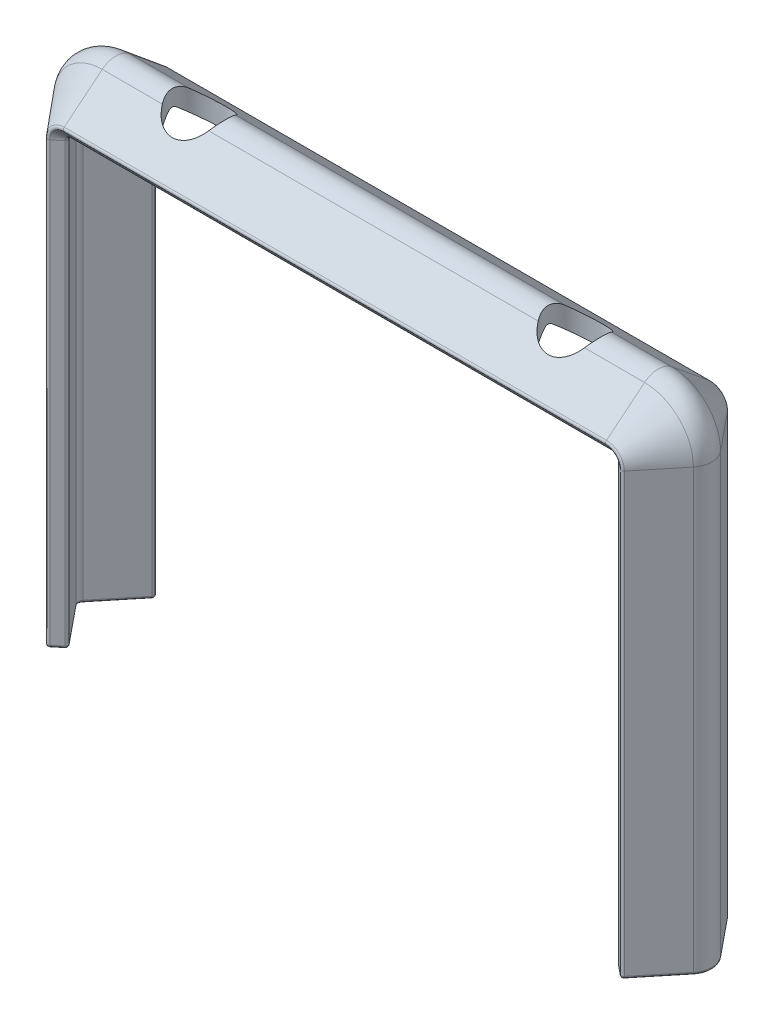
from build123d import *

# Parameters (mm, degrees)
CONG_1_R                = 0.25
ESQUISSE3_R             = 2.5
ENL_V_MAT_EXTRU_2_DEPTH = 56.272554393


with BuildPart() as part:
    # Base-Balayage: sweep along a path in Esquisse2
    with BuildLine(Plane.XY) as base_balayage_path:
        Line((-30.25, 0), (-30.25, 41))
        ThreePointArc((-30.25, 41), (-28.785533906, 44.535533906), (-25.25, 46))
        Line((-25.25, 46), (25.25, 46))
        ThreePointArc((25.25, 46), (28.785533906, 44.535533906), (30.25, 41))
        Line((30.25, 41), (30.25, 0))
    # Esquisse1 → Base-Balayage (sweep)
    with BuildSketch(Plane(origin=(0, 0, 0), x_dir=(1, 0, 0), z_dir=(0, 1, 0))):
        with BuildLine():
            Line((-26.75, 5), (-29.799293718, 1.264788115))
            ThreePointArc((-29.799293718, 1.264788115), (-30.25, 0), (-29.799293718, -1.264788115))
            Line((-29.799293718, -1.264788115), (-26.75, -5))
            Line((-26.75, -5), (-25.588029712, -4.051408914))
            Line((-25.588029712, -4.051408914), (-28.637323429, -0.316197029))
            ThreePointArc((-28.637323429, -0.316197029), (-28.75, 0), (-28.637323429, 0.316197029))
            Line((-28.637323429, 0.316197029), (-25.588029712, 4.051408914))
            Line((-25.588029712, 4.051408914), (-26.75, 5))
        make_face()
    sweep(path=base_balayage_path.line)

    # Cong_1
    cong_1_edges = [part.edges().sort_by_distance(p)[0] for p in [
        (-27.112676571, 0, -2.183802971),
        (-25.588029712, 20.5, -4.051408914),
        (-26.169014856, 0, -4.525704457),
        (-26.75, 20.5, -5),
        (-28.274646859, 0, -3.132394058),
        (-30.25, 0, 0),
        (-28.274646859, 0, 3.132394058),
        (-26.75, 20.5, 5),
        (-26.169014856, 0, 4.525704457),
        (-25.588029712, 20.5, 4.051408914),
        (-27.112676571, 0, 2.183802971),
        (-28.75, 0, 0),
        (-25.489023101, 41.239023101, -4.051408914),
        (-26.310660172, 42.060660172, -5),
        (-26.310660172, 42.060660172, 5),
        (-25.489023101, 41.239023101, 4.051408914),
        (0, 41.338029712, -4.051408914),
        (0, 42.5, -5),
        (0, 42.5, 5),
        (0, 41.338029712, 4.051408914),
        (25.489023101, 41.239023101, -4.051408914),
        (26.310660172, 42.060660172, -5),
        (26.310660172, 42.060660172, 5),
        (25.489023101, 41.239023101, 4.051408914),
        (25.588029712, 20.5, -4.051408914),
        (27.112676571, 0, -2.183802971),
        (26.75, 20.5, -5),
        (26.169014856, 0, -4.525704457),
        (28.274646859, 0, -3.132394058),
        (30.25, 0, 0),
        (26.75, 20.5, 5),
        (28.274646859, 0, 3.132394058),
        (25.588029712, 20.5, 4.051408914),
        (26.169014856, 0, 4.525704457),
        (27.112676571, 0, 2.183802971),
        (28.75, 0, 0),
    ]]
    fillet(cong_1_edges, radius=CONG_1_R)

    # Esquisse3 → Enl_v. mat.-Extru.2 (cut, through all)
    with BuildSketch(Plane(origin=(0, 0, 0), x_dir=(1, 0, 0), z_dir=(0, 1, 0))):
        with Locations(Location((17.5, 0, 0), (0, 0, 30.392127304))):
            Circle(ESQUISSE3_R)
        with Locations(Location((-17.5, 0, 0), (0, 0, 30.392127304))):
            Circle(ESQUISSE3_R)
    extrude(amount=ENL_V_MAT_EXTRU_2_DEPTH, mode=Mode.SUBTRACT)


solid = part.part
